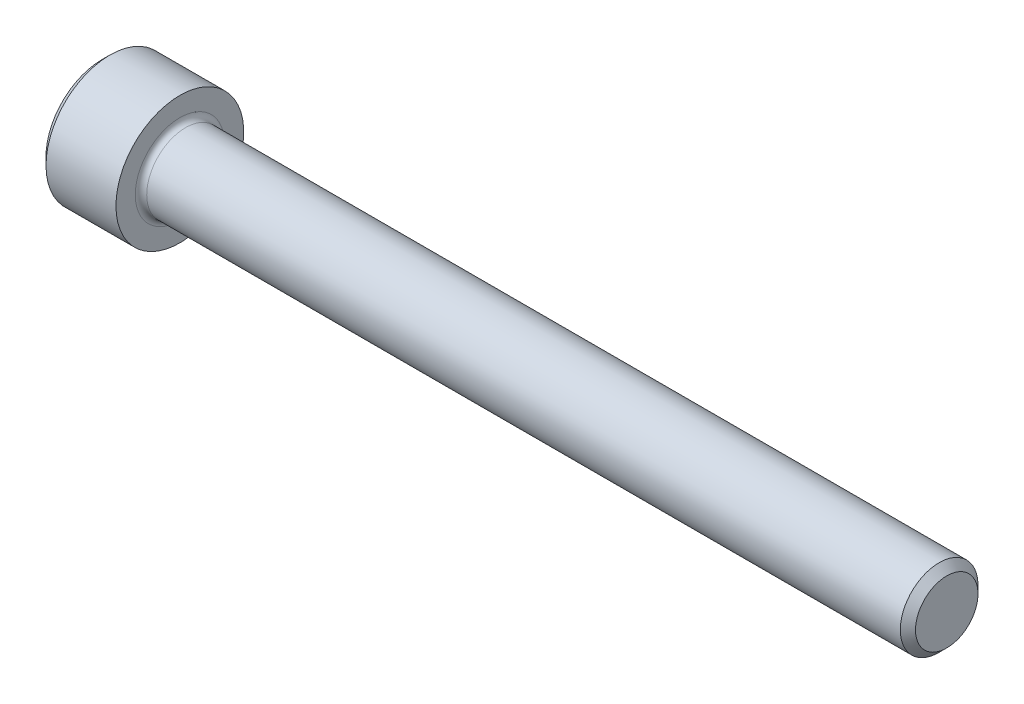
ISO-10303-21;
HEADER;
FILE_DESCRIPTION(('STEP AP214'),'2;1');
FILE_NAME('part.step','',(''),(''),'','','');
FILE_SCHEMA(('AUTOMOTIVE_DESIGN { 1 0 10303 214 1 1 1 1 }'));
ENDSEC;
DATA;
#1=APPLICATION_CONTEXT('core data for automotive mechanical design processes');
#2=APPLICATION_PROTOCOL_DEFINITION('international standard','automotive_design',2000,#1);
#3=PRODUCT_CONTEXT('',#1,'mechanical');
#4=PRODUCT('Part','Part','',(#3));
#5=PRODUCT_RELATED_PRODUCT_CATEGORY('part','',(#4));
#6=PRODUCT_DEFINITION_FORMATION('','',#4);
#7=PRODUCT_DEFINITION_CONTEXT('part definition',#1,'design');
#8=PRODUCT_DEFINITION('design','',#6,#7);
#9=PRODUCT_DEFINITION_SHAPE('','',#8);
#10=(LENGTH_UNIT() NAMED_UNIT(*) SI_UNIT(.MILLI.,.METRE.));
#11=(NAMED_UNIT(*) PLANE_ANGLE_UNIT() SI_UNIT($,.RADIAN.));
#12=(NAMED_UNIT(*) SI_UNIT($,.STERADIAN.) SOLID_ANGLE_UNIT());
#13=UNCERTAINTY_MEASURE_WITH_UNIT(LENGTH_MEASURE(1.E-05),#10,'distance_accuracy_value','');
#14=(GEOMETRIC_REPRESENTATION_CONTEXT(3) GLOBAL_UNCERTAINTY_ASSIGNED_CONTEXT((#13)) GLOBAL_UNIT_ASSIGNED_CONTEXT((#10,
#11,#12)) REPRESENTATION_CONTEXT('',''));
#15=CARTESIAN_POINT('',(0.,0.,0.));
#16=DIRECTION('',(0.,0.,1.));
#17=DIRECTION('',(1.,0.,0.));
#18=AXIS2_PLACEMENT_3D('',#15,#16,#17);
#19=CARTESIAN_POINT('',(2.286,3.4381381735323,-1.98501000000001));
#20=DIRECTION('',(1.,0.,0.));
#21=DIRECTION('',(0.,0.,-1.));
#22=AXIS2_PLACEMENT_3D('',#19,#20,#21);
#23=PLANE('',#22);
#24=DIRECTION('',(0.,1.,0.));
#25=VECTOR('',#24,1.);
#26=CARTESIAN_POINT('',(2.286,3.4381381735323,1.98501));
#27=LINE('',#26,#25);
#28=CARTESIAN_POINT('',(2.28599999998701,0.,1.98501000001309));
#29=VERTEX_POINT('',#28);
#30=CARTESIAN_POINT('',(2.286,-1.14604605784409,1.98501));
#31=VERTEX_POINT('',#30);
#32=EDGE_CURVE('E95',#29,#31,#27,.F.);
#33=ORIENTED_EDGE('',*,*,#32,.F.);
#34=CARTESIAN_POINT('',(2.2859999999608,0.,0.));
#35=DIRECTION('',(-1.,0.,0.));
#36=DIRECTION('',(0.,0.,1.));
#37=AXIS2_PLACEMENT_3D('',#34,#35,#36);
#38=CIRCLE('',#37,1.98501000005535);
#39=CARTESIAN_POINT('',(2.2859999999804,-1.71906908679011,0.992505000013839));
#40=VERTEX_POINT('',#39);
#41=EDGE_CURVE('E97',#29,#40,#38,.F.);
#42=ORIENTED_EDGE('',*,*,#41,.T.);
#43=DIRECTION('',(0.,-0.500000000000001,-0.866025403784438));
#44=VECTOR('',#43,1.);
#45=CARTESIAN_POINT('',(2.286,-1.14604605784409,1.98501));
#46=LINE('',#45,#44);
#47=EDGE_CURVE('E100',#31,#40,#46,.T.);
#48=ORIENTED_EDGE('',*,*,#47,.F.);
#49=EDGE_LOOP('',(#33,#42,#48));
#50=FACE_BOUND('',#49,.T.);
#51=ADVANCED_FACE('F16',(#50),#23,.F.);
#52=CARTESIAN_POINT('',(2.286,3.4381381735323,-1.98501000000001));
#53=DIRECTION('',(1.,0.,0.));
#54=DIRECTION('',(0.,0.,-1.));
#55=AXIS2_PLACEMENT_3D('',#52,#53,#54);
#56=PLANE('',#55);
#57=DIRECTION('',(0.,-0.500000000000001,-0.866025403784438));
#58=VECTOR('',#57,1.);
#59=CARTESIAN_POINT('',(2.286,-1.71906908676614,0.992504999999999));
#60=LINE('',#59,#58);
#61=CARTESIAN_POINT('',(2.286,-2.29209211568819,0.));
#62=VERTEX_POINT('',#61);
#63=EDGE_CURVE('E168',#40,#62,#60,.T.);
#64=ORIENTED_EDGE('',*,*,#63,.F.);
#65=CARTESIAN_POINT('',(2.2859999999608,0.,0.));
#66=DIRECTION('',(-1.,0.,0.));
#67=DIRECTION('',(0.,0.,1.));
#68=AXIS2_PLACEMENT_3D('',#65,#66,#67);
#69=CIRCLE('',#68,1.98501000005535);
#70=CARTESIAN_POINT('',(2.2859999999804,-1.71906908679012,-0.992505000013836));
#71=VERTEX_POINT('',#70);
#72=EDGE_CURVE('E115',#40,#71,#69,.F.);
#73=ORIENTED_EDGE('',*,*,#72,.T.);
#74=DIRECTION('',(0.,0.499999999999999,-0.866025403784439));
#75=VECTOR('',#74,1.);
#76=CARTESIAN_POINT('',(2.286,-2.29209211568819,0.));
#77=LINE('',#76,#75);
#78=EDGE_CURVE('E164',#62,#71,#77,.T.);
#79=ORIENTED_EDGE('',*,*,#78,.F.);
#80=EDGE_LOOP('',(#64,#73,#79));
#81=FACE_BOUND('',#80,.T.);
#82=ADVANCED_FACE('F340',(#81),#56,.F.);
#83=CARTESIAN_POINT('',(2.286,3.4381381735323,-1.98501000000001));
#84=DIRECTION('',(1.,0.,0.));
#85=DIRECTION('',(0.,0.,-1.));
#86=AXIS2_PLACEMENT_3D('',#83,#84,#85);
#87=PLANE('',#86);
#88=DIRECTION('',(0.,0.499999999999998,-0.86602540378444));
#89=VECTOR('',#88,1.);
#90=CARTESIAN_POINT('',(2.286,-1.71906908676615,-0.992504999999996));
#91=LINE('',#90,#89);
#92=CARTESIAN_POINT('',(2.286,-1.1460460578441,-1.98501));
#93=VERTEX_POINT('',#92);
#94=EDGE_CURVE('E160',#71,#93,#91,.T.);
#95=ORIENTED_EDGE('',*,*,#94,.F.);
#96=CARTESIAN_POINT('',(2.2859999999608,0.,0.));
#97=DIRECTION('',(-1.,0.,0.));
#98=DIRECTION('',(0.,0.,1.));
#99=AXIS2_PLACEMENT_3D('',#96,#97,#98);
#100=CIRCLE('',#99,1.98501000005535);
#101=CARTESIAN_POINT('',(2.28599999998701,0.,-1.98501000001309));
#102=VERTEX_POINT('',#101);
#103=EDGE_CURVE('E217',#71,#102,#100,.F.);
#104=ORIENTED_EDGE('',*,*,#103,.T.);
#105=DIRECTION('',(0.,1.,0.));
#106=VECTOR('',#105,1.);
#107=CARTESIAN_POINT('',(2.286,3.4381381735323,-1.98501));
#108=LINE('',#107,#106);
#109=EDGE_CURVE('E156',#93,#102,#108,.T.);
#110=ORIENTED_EDGE('',*,*,#109,.F.);
#111=EDGE_LOOP('',(#95,#104,#110));
#112=FACE_BOUND('',#111,.T.);
#113=ADVANCED_FACE('F337',(#112),#87,.F.);
#114=CARTESIAN_POINT('',(2.286,3.4381381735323,-1.98501000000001));
#115=DIRECTION('',(1.,0.,0.));
#116=DIRECTION('',(0.,0.,-1.));
#117=AXIS2_PLACEMENT_3D('',#114,#115,#116);
#118=PLANE('',#117);
#119=DIRECTION('',(0.,1.,0.));
#120=VECTOR('',#119,1.);
#121=CARTESIAN_POINT('',(2.286,3.4381381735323,-1.98501));
#122=LINE('',#121,#120);
#123=CARTESIAN_POINT('',(2.286,1.1460460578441,-1.98501));
#124=VERTEX_POINT('',#123);
#125=EDGE_CURVE('E152',#102,#124,#122,.T.);
#126=ORIENTED_EDGE('',*,*,#125,.F.);
#127=CARTESIAN_POINT('',(2.2859999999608,0.,0.));
#128=DIRECTION('',(-1.,0.,0.));
#129=DIRECTION('',(0.,0.,1.));
#130=AXIS2_PLACEMENT_3D('',#127,#128,#129);
#131=CIRCLE('',#130,1.98501000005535);
#132=CARTESIAN_POINT('',(2.2859999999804,1.71906908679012,-0.992505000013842));
#133=VERTEX_POINT('',#132);
#134=EDGE_CURVE('E214',#102,#133,#131,.F.);
#135=ORIENTED_EDGE('',*,*,#134,.T.);
#136=DIRECTION('',(0.,0.500000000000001,0.866025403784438));
#137=VECTOR('',#136,1.);
#138=CARTESIAN_POINT('',(2.286,1.1460460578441,-1.98501));
#139=LINE('',#138,#137);
#140=EDGE_CURVE('E148',#124,#133,#139,.T.);
#141=ORIENTED_EDGE('',*,*,#140,.F.);
#142=EDGE_LOOP('',(#126,#135,#141));
#143=FACE_BOUND('',#142,.T.);
#144=ADVANCED_FACE('F333',(#143),#118,.F.);
#145=CARTESIAN_POINT('',(2.286,3.4381381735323,-1.98501000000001));
#146=DIRECTION('',(1.,0.,0.));
#147=DIRECTION('',(0.,0.,-1.));
#148=AXIS2_PLACEMENT_3D('',#145,#146,#147);
#149=PLANE('',#148);
#150=DIRECTION('',(0.,0.500000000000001,0.866025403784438));
#151=VECTOR('',#150,1.);
#152=CARTESIAN_POINT('',(2.286,1.71906908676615,-0.992505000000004));
#153=LINE('',#152,#151);
#154=CARTESIAN_POINT('',(2.286,2.2920921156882,0.));
#155=VERTEX_POINT('',#154);
#156=EDGE_CURVE('E144',#133,#155,#153,.T.);
#157=ORIENTED_EDGE('',*,*,#156,.F.);
#158=CARTESIAN_POINT('',(2.2859999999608,0.,0.));
#159=DIRECTION('',(-1.,0.,0.));
#160=DIRECTION('',(0.,0.,1.));
#161=AXIS2_PLACEMENT_3D('',#158,#159,#160);
#162=CIRCLE('',#161,1.98501000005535);
#163=CARTESIAN_POINT('',(2.2859999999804,1.71906908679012,0.992505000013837));
#164=VERTEX_POINT('',#163);
#165=EDGE_CURVE('E123',#133,#164,#162,.F.);
#166=ORIENTED_EDGE('',*,*,#165,.T.);
#167=DIRECTION('',(0.,-0.499999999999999,0.866025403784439));
#168=VECTOR('',#167,1.);
#169=CARTESIAN_POINT('',(2.286,2.2920921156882,0.));
#170=LINE('',#169,#168);
#171=EDGE_CURVE('E116',#155,#164,#170,.T.);
#172=ORIENTED_EDGE('',*,*,#171,.F.);
#173=EDGE_LOOP('',(#157,#166,#172));
#174=FACE_BOUND('',#173,.T.);
#175=ADVANCED_FACE('F329',(#174),#149,.F.);
#176=CARTESIAN_POINT('',(2.28600000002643,0.,0.));
#177=DIRECTION('',(-1.,0.,0.));
#178=DIRECTION('',(0.,0.,1.));
#179=AXIS2_PLACEMENT_3D('',#176,#177,#178);
#180=CONICAL_SURFACE('',#179,1.98500999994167,1.04719755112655);
#181=CARTESIAN_POINT('',(3.43204605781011,0.,5.6843418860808E-11));
#182=VERTEX_POINT('',#181);
#183=VERTEX_LOOP('',#182);
#184=FACE_BOUND('',#183,.T.);
#185=ORIENTED_EDGE('',*,*,#41,.F.);
#186=CARTESIAN_POINT('',(2.2859999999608,0.,0.));
#187=DIRECTION('',(-1.,0.,0.));
#188=DIRECTION('',(0.,0.,1.));
#189=AXIS2_PLACEMENT_3D('',#186,#187,#188);
#190=CIRCLE('',#189,1.98501000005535);
#191=EDGE_CURVE('E111',#29,#164,#190,.T.);
#192=ORIENTED_EDGE('',*,*,#191,.T.);
#193=ORIENTED_EDGE('',*,*,#165,.F.);
#194=ORIENTED_EDGE('',*,*,#134,.F.);
#195=ORIENTED_EDGE('',*,*,#103,.F.);
#196=ORIENTED_EDGE('',*,*,#72,.F.);
#197=EDGE_LOOP('',(#185,#192,#193,#194,#195,#196));
#198=FACE_BOUND('',#197,.T.);
#199=ADVANCED_FACE('F109',(#184,#198),#180,.F.);
#200=CARTESIAN_POINT('',(2.286,3.4381381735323,-1.98501000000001));
#201=DIRECTION('',(1.,0.,0.));
#202=DIRECTION('',(0.,0.,-1.));
#203=AXIS2_PLACEMENT_3D('',#200,#201,#202);
#204=PLANE('',#203);
#205=DIRECTION('',(0.,0.499999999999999,-0.866025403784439));
#206=VECTOR('',#205,1.);
#207=CARTESIAN_POINT('',(2.286,2.2920921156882,0.));
#208=LINE('',#207,#206);
#209=CARTESIAN_POINT('',(2.286,1.14604605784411,1.98501));
#210=VERTEX_POINT('',#209);
#211=EDGE_CURVE('E122',#164,#210,#208,.F.);
#212=ORIENTED_EDGE('',*,*,#211,.F.);
#213=ORIENTED_EDGE('',*,*,#191,.F.);
#214=DIRECTION('',(0.,-1.,0.));
#215=VECTOR('',#214,1.);
#216=CARTESIAN_POINT('',(2.286,-1.14604605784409,1.98501));
#217=LINE('',#216,#215);
#218=EDGE_CURVE('E120',#29,#210,#217,.F.);
#219=ORIENTED_EDGE('',*,*,#218,.T.);
#220=EDGE_LOOP('',(#212,#213,#219));
#221=FACE_BOUND('',#220,.T.);
#222=ADVANCED_FACE('F119',(#221),#204,.F.);
#223=CARTESIAN_POINT('',(2.286,2.2920921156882,0.));
#224=DIRECTION('',(0.,-0.866025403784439,-0.499999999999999));
#225=DIRECTION('',(0.,0.499999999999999,-0.866025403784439));
#226=AXIS2_PLACEMENT_3D('',#223,#224,#225);
#227=PLANE('',#226);
#228=ORIENTED_EDGE('',*,*,#211,.T.);
#229=DIRECTION('',(1.,0.,0.));
#230=VECTOR('',#229,1.);
#231=CARTESIAN_POINT('',(2.286,1.14604605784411,1.98501));
#232=LINE('',#231,#230);
#233=CARTESIAN_POINT('',(0.,1.14604605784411,1.98501));
#234=VERTEX_POINT('',#233);
#235=EDGE_CURVE('E128',#210,#234,#232,.F.);
#236=ORIENTED_EDGE('',*,*,#235,.T.);
#237=DIRECTION('',(0.,-0.499999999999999,0.866025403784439));
#238=VECTOR('',#237,1.);
#239=CARTESIAN_POINT('',(0.,2.2920921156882,0.));
#240=LINE('',#239,#238);
#241=CARTESIAN_POINT('',(0.,2.2920921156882,0.));
#242=VERTEX_POINT('',#241);
#243=EDGE_CURVE('E135',#242,#234,#240,.T.);
#244=ORIENTED_EDGE('',*,*,#243,.F.);
#245=DIRECTION('',(1.,0.,0.));
#246=VECTOR('',#245,1.);
#247=CARTESIAN_POINT('',(2.286,2.2920921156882,0.));
#248=LINE('',#247,#246);
#249=EDGE_CURVE('E179',#242,#155,#248,.T.);
#250=ORIENTED_EDGE('',*,*,#249,.T.);
#251=ORIENTED_EDGE('',*,*,#171,.T.);
#252=EDGE_LOOP('',(#228,#236,#244,#250,#251));
#253=FACE_BOUND('',#252,.T.);
#254=ADVANCED_FACE('F321',(#253),#227,.T.);
#255=CARTESIAN_POINT('',(2.286,-1.14604605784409,1.98501));
#256=DIRECTION('',(0.,0.,1.));
#257=DIRECTION('',(0.,-1.,0.));
#258=AXIS2_PLACEMENT_3D('',#255,#256,#257);
#259=PLANE('',#258);
#260=ORIENTED_EDGE('',*,*,#235,.F.);
#261=ORIENTED_EDGE('',*,*,#218,.F.);
#262=ORIENTED_EDGE('',*,*,#32,.T.);
#263=DIRECTION('',(1.,0.,0.));
#264=VECTOR('',#263,1.);
#265=CARTESIAN_POINT('',(2.286,-1.14604605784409,1.98501));
#266=LINE('',#265,#264);
#267=CARTESIAN_POINT('',(0.,-1.14604605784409,1.98501));
#268=VERTEX_POINT('',#267);
#269=EDGE_CURVE('E130',#268,#31,#266,.T.);
#270=ORIENTED_EDGE('',*,*,#269,.F.);
#271=DIRECTION('',(0.,1.,0.));
#272=VECTOR('',#271,1.);
#273=CARTESIAN_POINT('',(0.,0.,1.98501));
#274=LINE('',#273,#272);
#275=EDGE_CURVE('E364',#234,#268,#274,.F.);
#276=ORIENTED_EDGE('',*,*,#275,.F.);
#277=EDGE_LOOP('',(#260,#261,#262,#270,#276));
#278=FACE_BOUND('',#277,.T.);
#279=ADVANCED_FACE('F126',(#278),#259,.F.);
#280=CARTESIAN_POINT('',(2.286,-1.14604605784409,1.98501));
#281=DIRECTION('',(0.,0.866025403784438,-0.500000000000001));
#282=DIRECTION('',(0.,0.500000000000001,0.866025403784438));
#283=AXIS2_PLACEMENT_3D('',#280,#281,#282);
#284=PLANE('',#283);
#285=ORIENTED_EDGE('',*,*,#63,.T.);
#286=DIRECTION('',(1.,0.,0.));
#287=VECTOR('',#286,1.);
#288=CARTESIAN_POINT('',(2.286,-2.29209211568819,0.));
#289=LINE('',#288,#287);
#290=CARTESIAN_POINT('',(0.,-2.29209211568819,0.));
#291=VERTEX_POINT('',#290);
#292=EDGE_CURVE('E190',#291,#62,#289,.T.);
#293=ORIENTED_EDGE('',*,*,#292,.F.);
#294=DIRECTION('',(0.,-0.500000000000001,-0.866025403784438));
#295=VECTOR('',#294,1.);
#296=CARTESIAN_POINT('',(0.,-1.14604605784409,1.98501));
#297=LINE('',#296,#295);
#298=EDGE_CURVE('E360',#268,#291,#297,.T.);
#299=ORIENTED_EDGE('',*,*,#298,.F.);
#300=ORIENTED_EDGE('',*,*,#269,.T.);
#301=ORIENTED_EDGE('',*,*,#47,.T.);
#302=EDGE_LOOP('',(#285,#293,#299,#300,#301));
#303=FACE_BOUND('',#302,.T.);
#304=ADVANCED_FACE('F314',(#303),#284,.T.);
#305=CARTESIAN_POINT('',(2.286,-2.29209211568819,0.));
#306=DIRECTION('',(0.,0.866025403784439,0.499999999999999));
#307=DIRECTION('',(0.,-0.499999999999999,0.866025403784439));
#308=AXIS2_PLACEMENT_3D('',#305,#306,#307);
#309=PLANE('',#308);
#310=ORIENTED_EDGE('',*,*,#94,.T.);
#311=DIRECTION('',(1.,0.,0.));
#312=VECTOR('',#311,1.);
#313=CARTESIAN_POINT('',(2.286,-1.1460460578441,-1.98501));
#314=LINE('',#313,#312);
#315=CARTESIAN_POINT('',(0.,-1.1460460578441,-1.98501));
#316=VERTEX_POINT('',#315);
#317=EDGE_CURVE('E183',#93,#316,#314,.F.);
#318=ORIENTED_EDGE('',*,*,#317,.T.);
#319=DIRECTION('',(0.,0.499999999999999,-0.866025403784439));
#320=VECTOR('',#319,1.);
#321=CARTESIAN_POINT('',(0.,-2.29209211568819,0.));
#322=LINE('',#321,#320);
#323=EDGE_CURVE('E353',#291,#316,#322,.T.);
#324=ORIENTED_EDGE('',*,*,#323,.F.);
#325=ORIENTED_EDGE('',*,*,#292,.T.);
#326=ORIENTED_EDGE('',*,*,#78,.T.);
#327=EDGE_LOOP('',(#310,#318,#324,#325,#326));
#328=FACE_BOUND('',#327,.T.);
#329=ADVANCED_FACE('F310',(#328),#309,.T.);
#330=CARTESIAN_POINT('',(2.286,1.1460460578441,-1.98501));
#331=DIRECTION('',(0.,0.,-1.));
#332=DIRECTION('',(0.,1.,0.));
#333=AXIS2_PLACEMENT_3D('',#330,#331,#332);
#334=PLANE('',#333);
#335=ORIENTED_EDGE('',*,*,#317,.F.);
#336=ORIENTED_EDGE('',*,*,#109,.T.);
#337=ORIENTED_EDGE('',*,*,#125,.T.);
#338=DIRECTION('',(1.,0.,0.));
#339=VECTOR('',#338,1.);
#340=CARTESIAN_POINT('',(2.286,1.1460460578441,-1.98501));
#341=LINE('',#340,#339);
#342=CARTESIAN_POINT('',(0.,1.1460460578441,-1.98501));
#343=VERTEX_POINT('',#342);
#344=EDGE_CURVE('E182',#124,#343,#341,.F.);
#345=ORIENTED_EDGE('',*,*,#344,.T.);
#346=DIRECTION('',(0.,1.,0.));
#347=VECTOR('',#346,1.);
#348=CARTESIAN_POINT('',(0.,0.,-1.98501));
#349=LINE('',#348,#347);
#350=EDGE_CURVE('E359',#316,#343,#349,.T.);
#351=ORIENTED_EDGE('',*,*,#350,.F.);
#352=EDGE_LOOP('',(#335,#336,#337,#345,#351));
#353=FACE_BOUND('',#352,.T.);
#354=ADVANCED_FACE('F306',(#353),#334,.F.);
#355=CARTESIAN_POINT('',(2.286,2.2920921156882,0.));
#356=DIRECTION('',(0.,0.866025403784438,-0.500000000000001));
#357=DIRECTION('',(0.,0.500000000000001,0.866025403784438));
#358=AXIS2_PLACEMENT_3D('',#355,#356,#357);
#359=PLANE('',#358);
#360=ORIENTED_EDGE('',*,*,#344,.F.);
#361=ORIENTED_EDGE('',*,*,#140,.T.);
#362=ORIENTED_EDGE('',*,*,#156,.T.);
#363=ORIENTED_EDGE('',*,*,#249,.F.);
#364=DIRECTION('',(0.,0.500000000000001,0.866025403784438));
#365=VECTOR('',#364,1.);
#366=CARTESIAN_POINT('',(0.,1.1460460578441,-1.98501));
#367=LINE('',#366,#365);
#368=EDGE_CURVE('E210',#343,#242,#367,.T.);
#369=ORIENTED_EDGE('',*,*,#368,.F.);
#370=EDGE_LOOP('',(#360,#361,#362,#363,#369));
#371=FACE_BOUND('',#370,.T.);
#372=ADVANCED_FACE('F302',(#371),#359,.F.);
#373=CARTESIAN_POINT('',(0.,0.,0.));
#374=DIRECTION('',(-1.,0.,0.));
#375=DIRECTION('',(0.,0.,1.));
#376=AXIS2_PLACEMENT_3D('',#373,#374,#375);
#377=PLANE('',#376);
#378=CARTESIAN_POINT('',(0.,0.,0.));
#379=DIRECTION('',(1.,0.,0.));
#380=DIRECTION('',(0.,1.,0.));
#381=AXIS2_PLACEMENT_3D('',#378,#379,#380);
#382=CIRCLE('',#381,3.48615000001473);
#383=CARTESIAN_POINT('',(0.,3.48615000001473,0.));
#384=VERTEX_POINT('',#383);
#385=EDGE_CURVE('E208',#384,#384,#382,.T.);
#386=ORIENTED_EDGE('',*,*,#385,.F.);
#387=EDGE_LOOP('',(#386));
#388=FACE_BOUND('',#387,.T.);
#389=ORIENTED_EDGE('',*,*,#350,.T.);
#390=ORIENTED_EDGE('',*,*,#368,.T.);
#391=ORIENTED_EDGE('',*,*,#243,.T.);
#392=ORIENTED_EDGE('',*,*,#275,.T.);
#393=ORIENTED_EDGE('',*,*,#298,.T.);
#394=ORIENTED_EDGE('',*,*,#323,.T.);
#395=EDGE_LOOP('',(#389,#390,#391,#392,#393,#394));
#396=FACE_BOUND('',#395,.T.);
#397=ADVANCED_FACE('F294',(#388,#396),#377,.T.);
#398=CARTESIAN_POINT('',(0.482599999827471,0.,0.));
#399=DIRECTION('',(1.,0.,0.));
#400=DIRECTION('',(0.,1.,0.));
#401=AXIS2_PLACEMENT_3D('',#398,#399,#400);
#402=CONICAL_SURFACE('',#401,3.9687499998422,0.785398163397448);
#403=ORIENTED_EDGE('',*,*,#385,.T.);
#404=EDGE_LOOP('',(#403));
#405=FACE_BOUND('',#404,.T.);
#406=CARTESIAN_POINT('',(0.4826,0.,0.));
#407=DIRECTION('',(-1.,0.,0.));
#408=DIRECTION('',(0.,0.,1.));
#409=AXIS2_PLACEMENT_3D('',#406,#407,#408);
#410=CIRCLE('',#409,3.96875);
#411=CARTESIAN_POINT('',(0.4826,0.,3.96875));
#412=VERTEX_POINT('',#411);
#413=EDGE_CURVE('E207',#412,#412,#410,.F.);
#414=ORIENTED_EDGE('',*,*,#413,.F.);
#415=EDGE_LOOP('',(#414));
#416=FACE_BOUND('',#415,.T.);
#417=ADVANCED_FACE('F289',(#405,#416),#402,.T.);
#418=CARTESIAN_POINT('',(-31.75,0.,0.));
#419=DIRECTION('',(-1.,0.,0.));
#420=DIRECTION('',(0.,0.,1.));
#421=AXIS2_PLACEMENT_3D('',#418,#419,#420);
#422=CYLINDRICAL_SURFACE('',#421,3.96875);
#423=CARTESIAN_POINT('',(4.826,0.,0.));
#424=DIRECTION('',(-1.,0.,0.));
#425=DIRECTION('',(0.,0.,1.));
#426=AXIS2_PLACEMENT_3D('',#423,#424,#425);
#427=CIRCLE('',#426,3.96875);
#428=CARTESIAN_POINT('',(4.826,0.,3.96875));
#429=VERTEX_POINT('',#428);
#430=EDGE_CURVE('E204',#429,#429,#427,.F.);
#431=ORIENTED_EDGE('',*,*,#430,.F.);
#432=EDGE_LOOP('',(#431));
#433=FACE_BOUND('',#432,.T.);
#434=ORIENTED_EDGE('',*,*,#413,.T.);
#435=EDGE_LOOP('',(#434));
#436=FACE_BOUND('',#435,.T.);
#437=ADVANCED_FACE('F285',(#433,#436),#422,.T.);
#438=CARTESIAN_POINT('',(52.451,1.94056,0.));
#439=DIRECTION('',(1.,0.,0.));
#440=DIRECTION('',(0.,0.,-1.));
#441=AXIS2_PLACEMENT_3D('',#438,#439,#440);
#442=PLANE('',#441);
#443=CARTESIAN_POINT('',(52.4509999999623,0.,0.));
#444=DIRECTION('',(-1.,0.,0.));
#445=DIRECTION('',(0.,0.,1.));
#446=AXIS2_PLACEMENT_3D('',#443,#444,#445);
#447=CIRCLE('',#446,1.94056000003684);
#448=CARTESIAN_POINT('',(52.4509999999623,0.,1.94056000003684));
#449=VERTEX_POINT('',#448);
#450=EDGE_CURVE('E200',#449,#449,#447,.T.);
#451=ORIENTED_EDGE('',*,*,#450,.F.);
#452=EDGE_LOOP('',(#451));
#453=FACE_BOUND('',#452,.T.);
#454=ADVANCED_FACE('F243',(#453),#442,.T.);
#455=CARTESIAN_POINT('',(4.826,3.96875,0.));
#456=DIRECTION('',(1.,0.,0.));
#457=DIRECTION('',(0.,0.,-1.));
#458=AXIS2_PLACEMENT_3D('',#455,#456,#457);
#459=PLANE('',#458);
#460=ORIENTED_EDGE('',*,*,#430,.T.);
#461=EDGE_LOOP('',(#460));
#462=FACE_BOUND('',#461,.T.);
#463=CARTESIAN_POINT('',(4.826,0.,0.));
#464=DIRECTION('',(1.,0.,0.));
#465=DIRECTION('',(0.,0.,1.));
#466=AXIS2_PLACEMENT_3D('',#463,#464,#465);
#467=CIRCLE('',#466,2.76859999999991);
#468=CARTESIAN_POINT('',(4.826,0.,-2.76859999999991));
#469=VERTEX_POINT('',#468);
#470=CARTESIAN_POINT('',(4.826,0.,2.76859999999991));
#471=VERTEX_POINT('',#470);
#472=EDGE_CURVE('E203',#469,#471,#467,.F.);
#473=ORIENTED_EDGE('',*,*,#472,.T.);
#474=CARTESIAN_POINT('',(4.826,0.,0.));
#475=DIRECTION('',(1.,0.,0.));
#476=DIRECTION('',(0.,0.,-1.));
#477=AXIS2_PLACEMENT_3D('',#474,#475,#476);
#478=CIRCLE('',#477,2.76859999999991);
#479=EDGE_CURVE('E35',#471,#469,#478,.F.);
#480=ORIENTED_EDGE('',*,*,#479,.T.);
#481=EDGE_LOOP('',(#473,#480));
#482=FACE_BOUND('',#481,.T.);
#483=ADVANCED_FACE('F224',(#462,#482),#459,.T.);
#484=CARTESIAN_POINT('',(51.9785600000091,0.,0.));
#485=DIRECTION('',(-1.,0.,0.));
#486=DIRECTION('',(0.,0.,1.));
#487=AXIS2_PLACEMENT_3D('',#484,#485,#486);
#488=CONICAL_SURFACE('',#487,2.41300000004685,0.785398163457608);
#489=CARTESIAN_POINT('',(51.9785599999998,0.,0.));
#490=DIRECTION('',(-1.,0.,0.));
#491=DIRECTION('',(0.,0.,1.));
#492=AXIS2_PLACEMENT_3D('',#489,#490,#491);
#493=CIRCLE('',#492,2.41299999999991);
#494=CARTESIAN_POINT('',(51.9785599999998,0.,2.41299999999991));
#495=VERTEX_POINT('',#494);
#496=EDGE_CURVE('E27',#495,#495,#493,.T.);
#497=ORIENTED_EDGE('',*,*,#496,.F.);
#498=EDGE_LOOP('',(#497));
#499=FACE_BOUND('',#498,.T.);
#500=ORIENTED_EDGE('',*,*,#450,.T.);
#501=EDGE_LOOP('',(#500));
#502=FACE_BOUND('',#501,.T.);
#503=ADVANCED_FACE('F242',(#499,#502),#488,.T.);
#504=CARTESIAN_POINT('',(5.1816,0.,0.));
#505=DIRECTION('',(1.,0.,0.));
#506=DIRECTION('',(0.,0.,-1.));
#507=AXIS2_PLACEMENT_3D('',#504,#505,#506);
#508=TOROIDAL_SURFACE('',#507,2.76859999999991,0.3556);
#509=CARTESIAN_POINT('',(5.1816,0.,0.));
#510=DIRECTION('',(-1.,0.,0.));
#511=DIRECTION('',(0.,0.,1.));
#512=AXIS2_PLACEMENT_3D('',#509,#510,#511);
#513=CIRCLE('',#512,2.41299999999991);
#514=CARTESIAN_POINT('',(5.1816,0.,2.41299999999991));
#515=VERTEX_POINT('',#514);
#516=EDGE_CURVE('E11',#515,#515,#513,.F.);
#517=ORIENTED_EDGE('',*,*,#516,.F.);
#518=EDGE_LOOP('',(#517));
#519=FACE_BOUND('',#518,.T.);
#520=ORIENTED_EDGE('',*,*,#472,.F.);
#521=ORIENTED_EDGE('',*,*,#479,.F.);
#522=EDGE_LOOP('',(#520,#521));
#523=FACE_BOUND('',#522,.T.);
#524=ADVANCED_FACE('F221',(#519,#523),#508,.F.);
#525=CARTESIAN_POINT('',(-31.75,0.,0.));
#526=DIRECTION('',(-1.,0.,0.));
#527=DIRECTION('',(0.,0.,1.));
#528=AXIS2_PLACEMENT_3D('',#525,#526,#527);
#529=CYLINDRICAL_SURFACE('',#528,2.41299999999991);
#530=ORIENTED_EDGE('',*,*,#516,.T.);
#531=EDGE_LOOP('',(#530));
#532=FACE_BOUND('',#531,.T.);
#533=ORIENTED_EDGE('',*,*,#496,.T.);
#534=EDGE_LOOP('',(#533));
#535=FACE_BOUND('',#534,.T.);
#536=ADVANCED_FACE('F267',(#532,#535),#529,.T.);
#537=CLOSED_SHELL('',(#51,#82,#113,#144,#175,#199,#222,#254,#279,#304,#329,#354,#372,#397,#417,
#437,#454,#483,#503,#524,#536));
#538=MANIFOLD_SOLID_BREP('B1',#537);
#539=ADVANCED_BREP_SHAPE_REPRESENTATION('',(#18,#538),#14);
#540=SHAPE_DEFINITION_REPRESENTATION(#9,#539);
ENDSEC;
END-ISO-10303-21;
